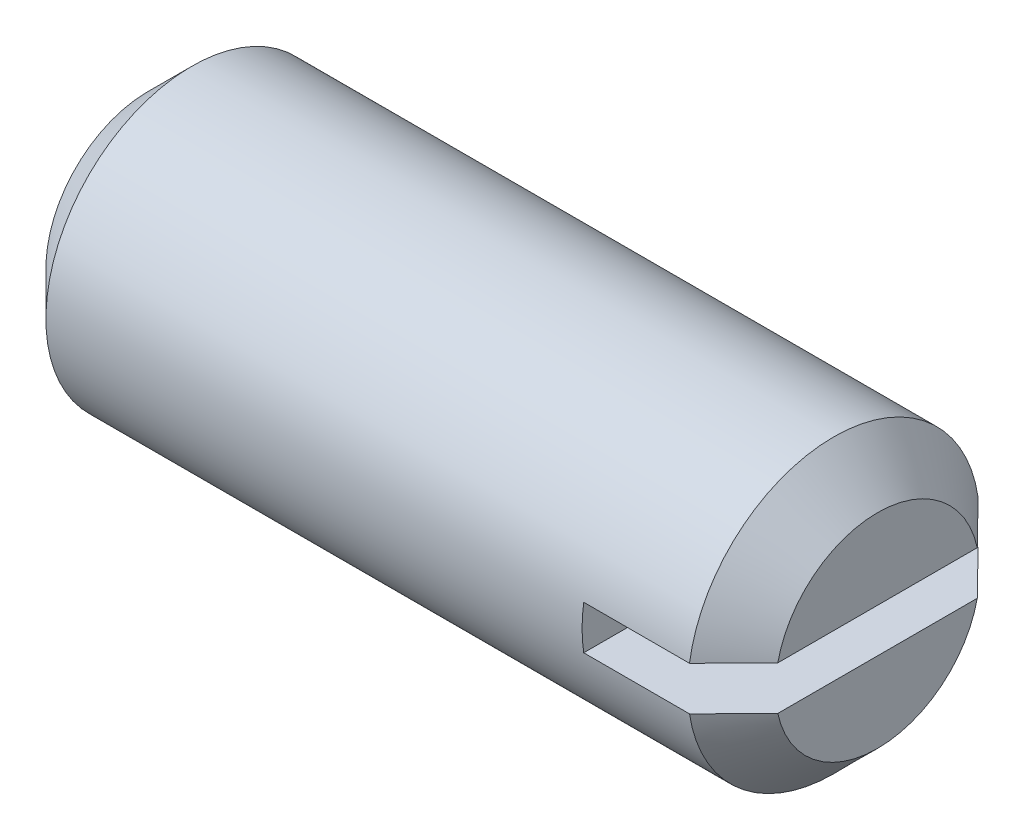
from build123d import *

# Parameters (mm, degrees)
SKETCH1_R          = 2
BODY_DEPTH         = 10
CHAMFER1_SIZE      = 0.6
SPLIT_2_DEPTH      = 12.606086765
SPLIT_2_DEPTH_BACK = 12.606086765
SKETCH2_W          = 0.6
SKETCH2_H          = 2.05


with BuildPart() as part:
    # Sketch1 → Body (new body)
    with BuildSketch(Plane(origin=(0, 0, 0), x_dir=(0, 0, -1), z_dir=(1, 0, 0))):
        Circle(SKETCH1_R)
    extrude(amount=BODY_DEPTH)

    # Chamfer1
    chamfer1_edges = [part.edges().sort_by_distance(p)[0] for p in [
        (0, 0, 2),
        (10, 0, 2),
    ]]
    chamfer(chamfer1_edges, length=CHAMFER1_SIZE)

    # Sketch2 → Split 2 (cut, two sides: drawn at the far end of the back side and taken through both)
    with BuildSketch(Plane(origin=(-1.025, -1.025, 0), x_dir=(0, 1, 0), z_dir=(0, 0, 1)).offset(-SPLIT_2_DEPTH_BACK)):
        with Locations((1.025, -10)):
            Rectangle(SKETCH2_W, SKETCH2_H)
    extrude(amount=SPLIT_2_DEPTH + SPLIT_2_DEPTH_BACK, mode=Mode.SUBTRACT)


solid = part.part
